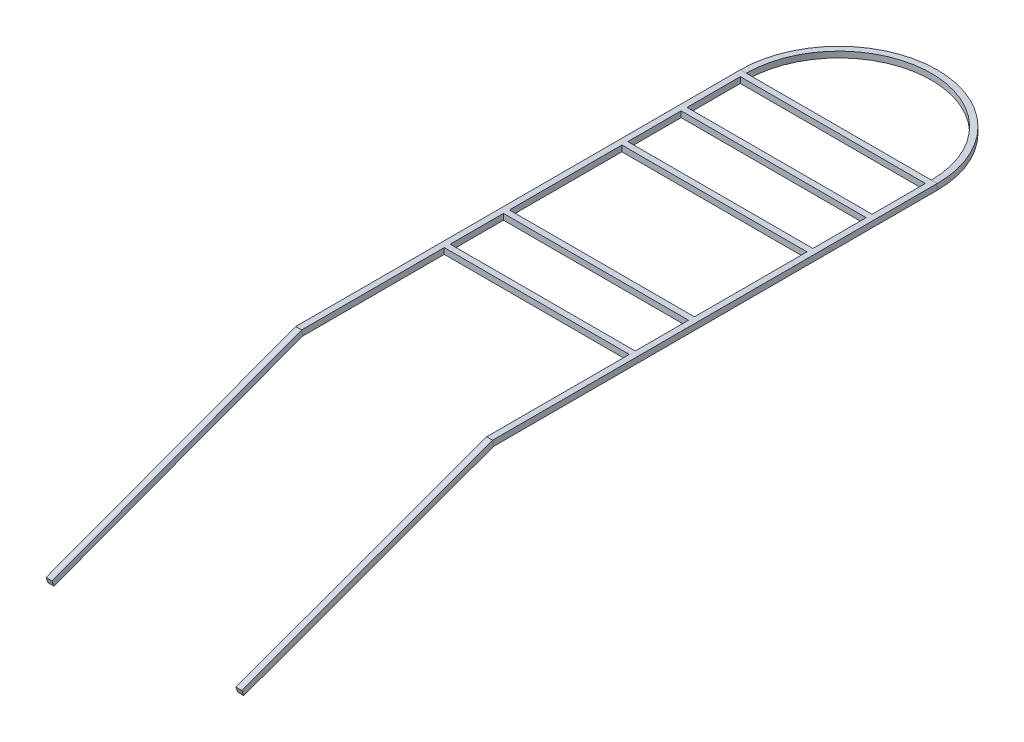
from build123d import *

# Parameters (mm, degrees)
SCHIZZO9_W                   = 4
SCHIZZO9_H                   = 4
ESTRUSIONE_ESTRUSIONE2_REACH = 395.686
SCHIZZO10_W                  = 4
SCHIZZO10_H                  = 4
RIPETIZIONE_A_L4_COUNT       = 6
RIPETIZIONE_A_L4_PITCH       = 40


with BuildPart() as part:
    # Sweep4: sweep along a curve in space
    with BuildLine() as sweep4_path:
        Line((0, 0, 0), (0, -61.563625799, 169.144671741))
        Line((0, 0, 0), (0, 0, -300))
        ThreePointArc((-129, 0, -300), (-64.5, 0, -364.5), (0, 0, -300))
        Line((-129, 0, -300), (-129, 0, 0))
        Line((-129, 0, 0), (-128.17922445, -61.563625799, 169.144671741))
    # Schizzo9 → Sweep4 (sweep)
    with BuildSketch(Plane(origin=(0, -61.563625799, 169.144671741), x_dir=(1, 0, 0), z_dir=(0, -0.34202014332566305, 0.9396926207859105))):
        Rectangle(SCHIZZO9_W, SCHIZZO9_H)
    sweep(path=sweep4_path.line, transition=Transition.RIGHT)

    # Estrusione-Estrusione2: up to this face of the body (flat: up to its plane)
    estrusione_estrusione2_end = Plane(part.part.faces().sort_by_distance((-127, 0.000783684, -150.002281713))[0])
    # Schizzo10 → Estrusione-Estrusione2 (add, up to the picked face)
    with BuildSketch(Plane.ZY.offset(2), mode=Mode.PRIVATE) as estrusione_estrusione2_sk1:
        with Locations((-298, 0)):
            Rectangle(SCHIZZO10_W, SCHIZZO10_H)
    estrusione_estrusione2_tool1 = split(extrude(estrusione_estrusione2_sk1.sketch, amount=ESTRUSIONE_ESTRUSIONE2_REACH, mode=Mode.PRIVATE), bisect_by=estrusione_estrusione2_end, keep=Keep.BOTH, mode=Mode.PRIVATE)
    estrusione_estrusione2 = estrusione_estrusione2_tool1.solids().sort_by(Axis((-2, 0, -298), (-1, 0, 0)))[0]
    add(estrusione_estrusione2)

    # Ripetizione a L4: Estrusione-Estrusione2 ×6, 1 skipped
    with Locations(*[(0, 0, i * RIPETIZIONE_A_L4_PITCH) for i in range(1, RIPETIZIONE_A_L4_COUNT) if i not in (3,)]):
        add(estrusione_estrusione2)


solid = part.part
